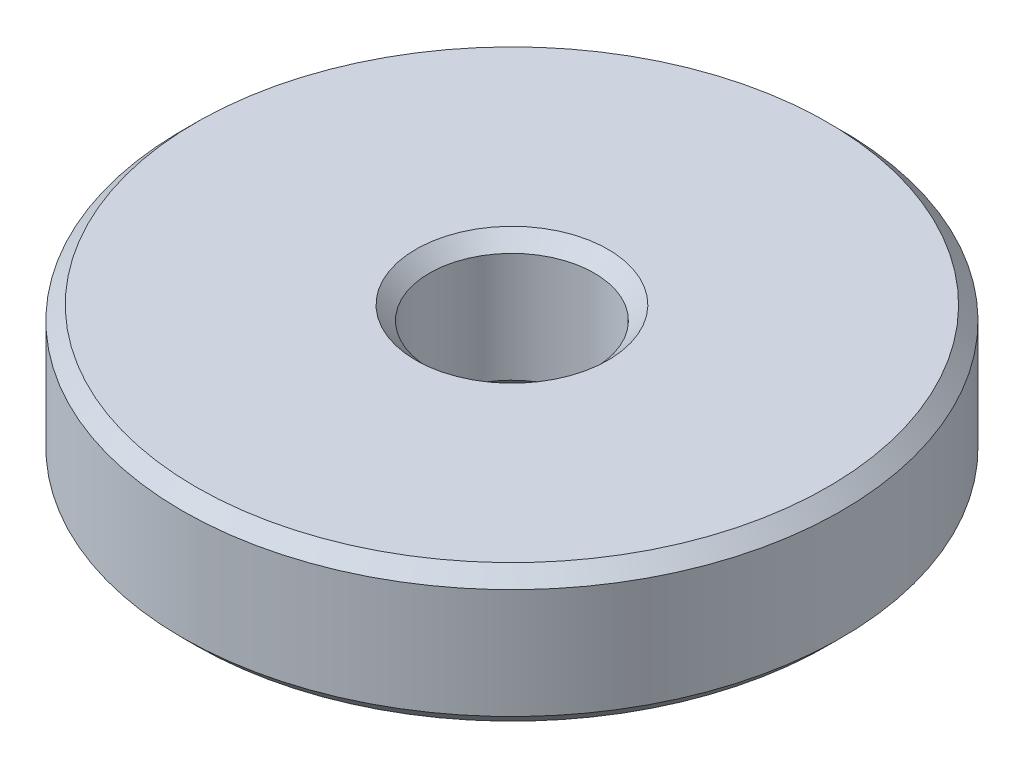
ISO-10303-21;
HEADER;
FILE_DESCRIPTION(('STEP AP214'),'2;1');
FILE_NAME('part.step','',(''),(''),'','','');
FILE_SCHEMA(('AUTOMOTIVE_DESIGN { 1 0 10303 214 1 1 1 1 }'));
ENDSEC;
DATA;
#1=APPLICATION_CONTEXT('core data for automotive mechanical design processes');
#2=APPLICATION_PROTOCOL_DEFINITION('international standard','automotive_design',2000,#1);
#3=PRODUCT_CONTEXT('',#1,'mechanical');
#4=PRODUCT('Part','Part','',(#3));
#5=PRODUCT_RELATED_PRODUCT_CATEGORY('part','',(#4));
#6=PRODUCT_DEFINITION_FORMATION('','',#4);
#7=PRODUCT_DEFINITION_CONTEXT('part definition',#1,'design');
#8=PRODUCT_DEFINITION('design','',#6,#7);
#9=PRODUCT_DEFINITION_SHAPE('','',#8);
#10=(LENGTH_UNIT() NAMED_UNIT(*) SI_UNIT(.MILLI.,.METRE.));
#11=(NAMED_UNIT(*) PLANE_ANGLE_UNIT() SI_UNIT($,.RADIAN.));
#12=(NAMED_UNIT(*) SI_UNIT($,.STERADIAN.) SOLID_ANGLE_UNIT());
#13=UNCERTAINTY_MEASURE_WITH_UNIT(LENGTH_MEASURE(1.E-05),#10,'distance_accuracy_value','');
#14=(GEOMETRIC_REPRESENTATION_CONTEXT(3) GLOBAL_UNCERTAINTY_ASSIGNED_CONTEXT((#13)) GLOBAL_UNIT_ASSIGNED_CONTEXT((#10,
#11,#12)) REPRESENTATION_CONTEXT('',''));
#15=CARTESIAN_POINT('',(0.,0.,0.));
#16=DIRECTION('',(0.,0.,1.));
#17=DIRECTION('',(1.,0.,0.));
#18=AXIS2_PLACEMENT_3D('',#15,#16,#17);
#19=CARTESIAN_POINT('',(0.,5.,0.));
#20=DIRECTION('',(0.,-1.,0.));
#21=DIRECTION('',(0.,0.,-1.));
#22=AXIS2_PLACEMENT_3D('',#19,#20,#21);
#23=CYLINDRICAL_SURFACE('',#22,12.);
#24=CARTESIAN_POINT('',(0.,0.5,0.));
#25=DIRECTION('',(0.,1.,0.));
#26=DIRECTION('',(0.,0.,1.));
#27=AXIS2_PLACEMENT_3D('',#24,#25,#26);
#28=CIRCLE('',#27,12.);
#29=CARTESIAN_POINT('',(0.,0.5,12.));
#30=VERTEX_POINT('',#29);
#31=EDGE_CURVE('E42',#30,#30,#28,.T.);
#32=ORIENTED_EDGE('',*,*,#31,.T.);
#33=EDGE_LOOP('',(#32));
#34=FACE_BOUND('',#33,.T.);
#35=CARTESIAN_POINT('',(0.,4.5,0.));
#36=DIRECTION('',(0.,1.,0.));
#37=DIRECTION('',(0.,0.,1.));
#38=AXIS2_PLACEMENT_3D('',#35,#36,#37);
#39=CIRCLE('',#38,12.);
#40=CARTESIAN_POINT('',(0.,4.5,12.));
#41=VERTEX_POINT('',#40);
#42=EDGE_CURVE('E45',#41,#41,#39,.F.);
#43=ORIENTED_EDGE('',*,*,#42,.T.);
#44=EDGE_LOOP('',(#43));
#45=FACE_BOUND('',#44,.T.);
#46=ADVANCED_FACE('F15',(#34,#45),#23,.T.);
#47=CARTESIAN_POINT('',(0.,5.,0.));
#48=DIRECTION('',(0.,1.,0.));
#49=DIRECTION('',(0.,0.,1.));
#50=AXIS2_PLACEMENT_3D('',#47,#48,#49);
#51=PLANE('',#50);
#52=CARTESIAN_POINT('',(0.,5.,0.));
#53=DIRECTION('',(0.,1.,0.));
#54=DIRECTION('',(0.,0.,1.));
#55=AXIS2_PLACEMENT_3D('',#52,#53,#54);
#56=CIRCLE('',#55,3.5);
#57=CARTESIAN_POINT('',(0.,5.,3.5));
#58=VERTEX_POINT('',#57);
#59=EDGE_CURVE('E23',#58,#58,#56,.F.);
#60=ORIENTED_EDGE('',*,*,#59,.T.);
#61=EDGE_LOOP('',(#60));
#62=FACE_BOUND('',#61,.T.);
#63=CARTESIAN_POINT('',(0.,5.,0.));
#64=DIRECTION('',(0.,1.,0.));
#65=DIRECTION('',(0.,0.,1.));
#66=AXIS2_PLACEMENT_3D('',#63,#64,#65);
#67=CIRCLE('',#66,11.5);
#68=CARTESIAN_POINT('',(0.,5.,11.5));
#69=VERTEX_POINT('',#68);
#70=EDGE_CURVE('E36',#69,#69,#67,.T.);
#71=ORIENTED_EDGE('',*,*,#70,.T.);
#72=EDGE_LOOP('',(#71));
#73=FACE_BOUND('',#72,.T.);
#74=ADVANCED_FACE('F58',(#62,#73),#51,.T.);
#75=CARTESIAN_POINT('',(0.,0.,0.));
#76=DIRECTION('',(0.,1.,0.));
#77=DIRECTION('',(0.,0.,1.));
#78=AXIS2_PLACEMENT_3D('',#75,#76,#77);
#79=PLANE('',#78);
#80=CARTESIAN_POINT('',(0.,0.,0.));
#81=DIRECTION('',(0.,1.,0.));
#82=DIRECTION('',(0.,0.,1.));
#83=AXIS2_PLACEMENT_3D('',#80,#81,#82);
#84=CIRCLE('',#83,3.5);
#85=CARTESIAN_POINT('',(0.,0.,3.5));
#86=VERTEX_POINT('',#85);
#87=EDGE_CURVE('E10',#86,#86,#84,.T.);
#88=ORIENTED_EDGE('',*,*,#87,.T.);
#89=EDGE_LOOP('',(#88));
#90=FACE_BOUND('',#89,.T.);
#91=CARTESIAN_POINT('',(0.,0.,0.));
#92=DIRECTION('',(0.,1.,0.));
#93=DIRECTION('',(0.,0.,1.));
#94=AXIS2_PLACEMENT_3D('',#91,#92,#93);
#95=CIRCLE('',#94,11.5);
#96=CARTESIAN_POINT('',(0.,0.,11.5));
#97=VERTEX_POINT('',#96);
#98=EDGE_CURVE('E39',#97,#97,#95,.F.);
#99=ORIENTED_EDGE('',*,*,#98,.T.);
#100=EDGE_LOOP('',(#99));
#101=FACE_BOUND('',#100,.T.);
#102=ADVANCED_FACE('F60',(#90,#101),#79,.F.);
#103=CARTESIAN_POINT('',(0.,0.5,0.));
#104=DIRECTION('',(0.,1.,0.));
#105=DIRECTION('',(0.,0.,1.));
#106=AXIS2_PLACEMENT_3D('',#103,#104,#105);
#107=CONICAL_SURFACE('',#106,12.,0.78539816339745);
#108=ORIENTED_EDGE('',*,*,#98,.F.);
#109=EDGE_LOOP('',(#108));
#110=FACE_BOUND('',#109,.T.);
#111=ORIENTED_EDGE('',*,*,#31,.F.);
#112=EDGE_LOOP('',(#111));
#113=FACE_BOUND('',#112,.T.);
#114=ADVANCED_FACE('F54',(#110,#113),#107,.T.);
#115=CARTESIAN_POINT('',(0.,5.,0.));
#116=DIRECTION('',(0.,-1.,0.));
#117=DIRECTION('',(0.,0.,-1.));
#118=AXIS2_PLACEMENT_3D('',#115,#116,#117);
#119=CONICAL_SURFACE('',#118,11.5,0.785398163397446);
#120=ORIENTED_EDGE('',*,*,#42,.F.);
#121=EDGE_LOOP('',(#120));
#122=FACE_BOUND('',#121,.T.);
#123=ORIENTED_EDGE('',*,*,#70,.F.);
#124=EDGE_LOOP('',(#123));
#125=FACE_BOUND('',#124,.T.);
#126=ADVANCED_FACE('F50',(#122,#125),#119,.T.);
#127=CARTESIAN_POINT('',(0.,5.,0.));
#128=DIRECTION('',(0.,1.,0.));
#129=DIRECTION('',(0.,0.,1.));
#130=AXIS2_PLACEMENT_3D('',#127,#128,#129);
#131=CYLINDRICAL_SURFACE('',#130,3.);
#132=CARTESIAN_POINT('',(0.,4.5,0.));
#133=DIRECTION('',(0.,1.,0.));
#134=DIRECTION('',(0.,0.,1.));
#135=AXIS2_PLACEMENT_3D('',#132,#133,#134);
#136=CIRCLE('',#135,3.);
#137=CARTESIAN_POINT('',(0.,4.5,3.));
#138=VERTEX_POINT('',#137);
#139=EDGE_CURVE('E27',#138,#138,#136,.T.);
#140=ORIENTED_EDGE('',*,*,#139,.T.);
#141=EDGE_LOOP('',(#140));
#142=FACE_BOUND('',#141,.T.);
#143=CARTESIAN_POINT('',(0.,0.5,0.));
#144=DIRECTION('',(0.,1.,0.));
#145=DIRECTION('',(0.,0.,1.));
#146=AXIS2_PLACEMENT_3D('',#143,#144,#145);
#147=CIRCLE('',#146,3.);
#148=CARTESIAN_POINT('',(0.,0.5,3.));
#149=VERTEX_POINT('',#148);
#150=EDGE_CURVE('E31',#149,#149,#147,.F.);
#151=ORIENTED_EDGE('',*,*,#150,.T.);
#152=EDGE_LOOP('',(#151));
#153=FACE_BOUND('',#152,.T.);
#154=ADVANCED_FACE('F53',(#142,#153),#131,.F.);
#155=CARTESIAN_POINT('',(0.,4.5,0.));
#156=DIRECTION('',(0.,1.,0.));
#157=DIRECTION('',(0.,0.,1.));
#158=AXIS2_PLACEMENT_3D('',#155,#156,#157);
#159=CONICAL_SURFACE('',#158,3.,0.785398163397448);
#160=ORIENTED_EDGE('',*,*,#59,.F.);
#161=EDGE_LOOP('',(#160));
#162=FACE_BOUND('',#161,.T.);
#163=ORIENTED_EDGE('',*,*,#139,.F.);
#164=EDGE_LOOP('',(#163));
#165=FACE_BOUND('',#164,.T.);
#166=ADVANCED_FACE('F76',(#162,#165),#159,.F.);
#167=CARTESIAN_POINT('',(0.,0.,0.));
#168=DIRECTION('',(0.,-1.,0.));
#169=DIRECTION('',(0.,0.,-1.));
#170=AXIS2_PLACEMENT_3D('',#167,#168,#169);
#171=CONICAL_SURFACE('',#170,3.5,0.785398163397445);
#172=ORIENTED_EDGE('',*,*,#150,.F.);
#173=EDGE_LOOP('',(#172));
#174=FACE_BOUND('',#173,.T.);
#175=ORIENTED_EDGE('',*,*,#87,.F.);
#176=EDGE_LOOP('',(#175));
#177=FACE_BOUND('',#176,.T.);
#178=ADVANCED_FACE('F18',(#174,#177),#171,.F.);
#179=CLOSED_SHELL('',(#46,#74,#102,#114,#126,#154,#166,#178));
#180=MANIFOLD_SOLID_BREP('B1',#179);
#181=ADVANCED_BREP_SHAPE_REPRESENTATION('',(#18,#180),#14);
#182=SHAPE_DEFINITION_REPRESENTATION(#9,#181);
ENDSEC;
END-ISO-10303-21;
